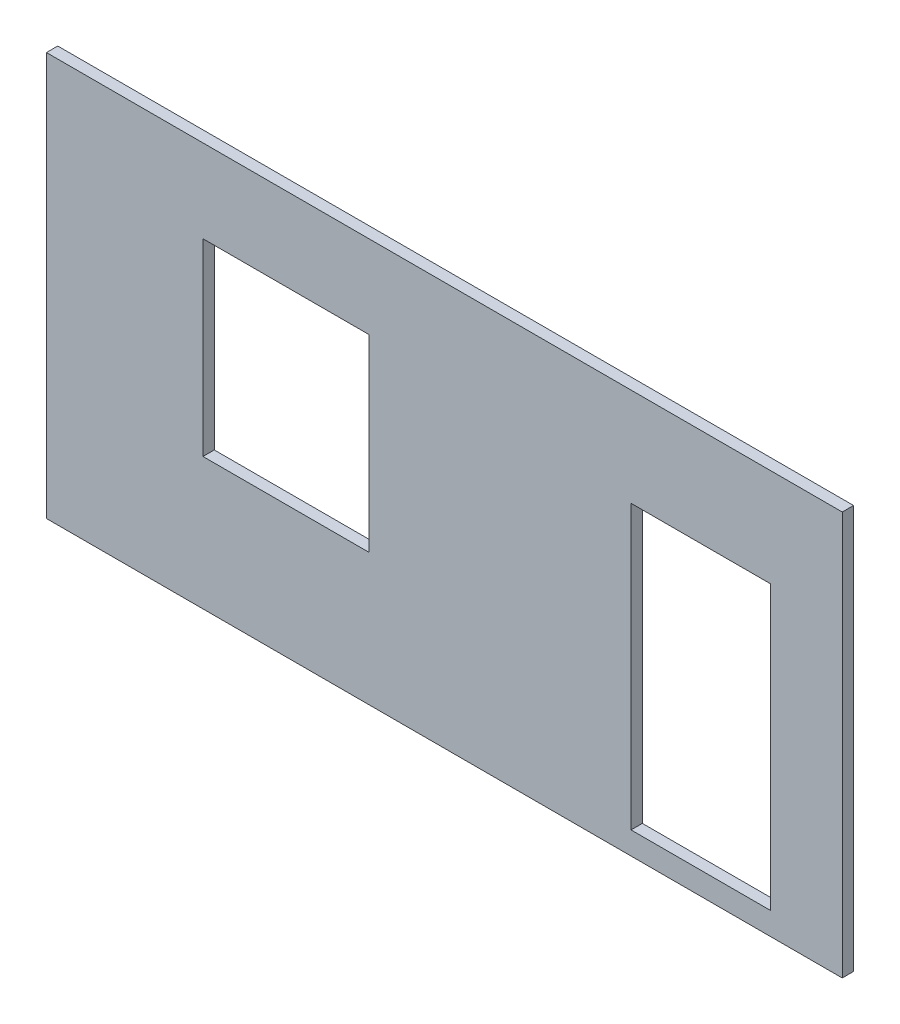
from build123d import *

# Parameters (mm, degrees)
ESQUISSE1_W             = 211
ESQUISSE1_H             = 107
EXTRUSION1_DEPTH        = 3
ESQUISSE2_W             = 44
ESQUISSE2_H             = 50
ESQUISSE2_W_2           = 37
ESQUISSE2_H_2           = 75
ENL_V_MAT_EXTRU_1_DEPTH = 3


with BuildPart() as part:
    # Esquisse1 → Extrusion1 (new body)
    with BuildSketch(Plane.XY):
        with Locations((105.5, 53.5)):
            Rectangle(ESQUISSE1_W, ESQUISSE1_H)
    extrude(amount=EXTRUSION1_DEPTH)

    # Esquisse2 → Enl_v. mat.-Extru.1 (cut)
    with BuildSketch(Plane.XY.offset(3)):
        with Locations((63.5, 60)):
            Rectangle(ESQUISSE2_W, ESQUISSE2_H)
        with Locations((173.5, 43.5)):
            Rectangle(ESQUISSE2_W_2, ESQUISSE2_H_2)
    extrude(amount=-ENL_V_MAT_EXTRU_1_DEPTH, mode=Mode.SUBTRACT)


solid = part.part
